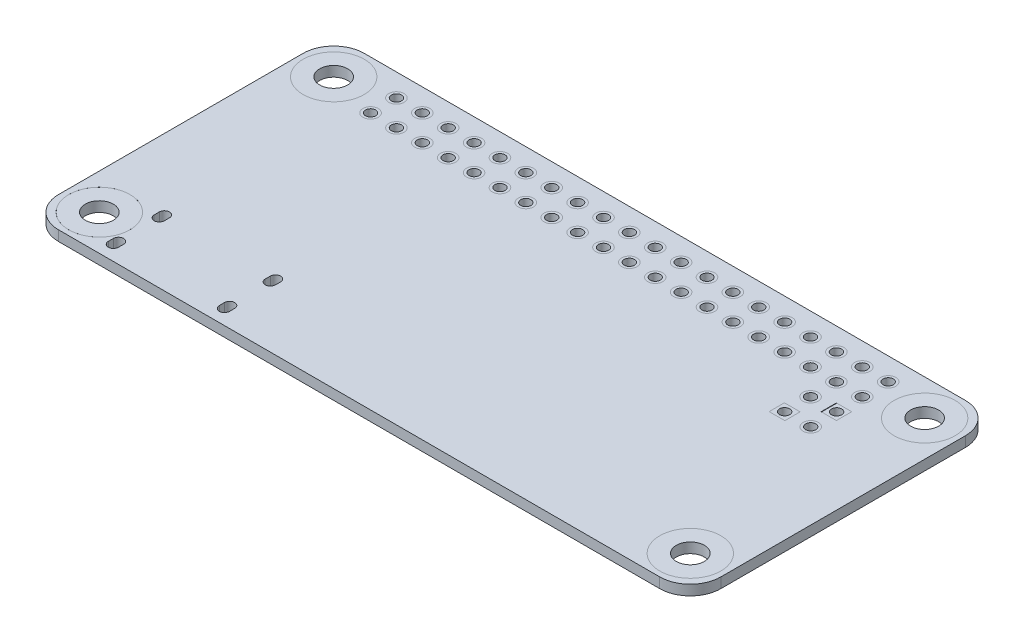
from build123d import *

# Parameters (mm, degrees)
SKETCH1_R             = 3
SKETCH1_R_2           = 0.75
SKETCH1_W             = 1.499997
SKETCH1_H             = 1.5
SKETCH1_W_2           = 1.5
BOSS_EXTRUDE1_DEPTH   = 1
SKETCH2_R             = 0.75
SKETCH2_R_2           = 0.5
BOSS_EXTRUDE2_DEPTH   = 1
LPATTERN2_COUNT       = 20
LPATTERN2_PITCH       = 2.54
LPATTERN2_2_COUNT     = 2
LPATTERN2_2_PITCH     = 2.54
SKETCH3_R             = 0.75
SKETCH3_R_2           = 0.5
BOSS_EXTRUDE3_DEPTH   = 1
BOSS_EXTRUDE3_2_DEPTH = 1
SKETCH3_W             = 1.541222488
SKETCH3_H             = 1.5
BOSS_EXTRUDE3_3_DEPTH = 1
SKETCH3_W_2           = 1.458777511
BOSS_EXTRUDE3_4_DEPTH = 1
SKETCH4_R             = 3
SKETCH4_R_2           = 1.375
BOSS_EXTRUDE4_DEPTH   = 1
CUT_EXTRUDE1_DEPTH    = 1


with BuildPart() as part:
    # Sketch1 → Boss-Extrude1 (new body)
    with BuildSketch(Plane(origin=(0, 0, 0), x_dir=(1, 0, 0), z_dir=(0, 1, 0))):
        with BuildLine():
            Line((-29.5, -15), (29.5, -15))
            ThreePointArc((29.5, -15), (31.621320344, -14.121320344), (32.5, -12))
            Line((32.5, -12), (32.5, 12))
            ThreePointArc((32.5, 12), (31.621320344, 14.121320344), (29.5, 15))
            Line((29.5, 15), (-29.5, 15))
            ThreePointArc((-29.5, 15), (-31.621320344, 14.121320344), (-32.5, 12))
            Line((-32.5, 12), (-32.5, -12))
            ThreePointArc((-32.5, -12), (-31.621320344, -14.121320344), (-29.5, -15))
        make_face()
        with Locations(Location((-29, 11.5, 0), (0, 0, 270))):
            Circle(SKETCH1_R, mode=Mode.SUBTRACT)
        with Locations(Location((-29, -11.5, 0), (0, 0, 270))):
            Circle(SKETCH1_R, mode=Mode.SUBTRACT)
        with Locations(Location((29, -11.5, 0), (0, 0, 90))):
            Circle(SKETCH1_R, mode=Mode.SUBTRACT)
        with Locations(Location((-24.13, 12.787653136, 0), (0, 0, 270))):
            Circle(SKETCH1_R_2, mode=Mode.SUBTRACT)
        with Locations(Location((-21.59, 12.787653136, 0), (0, 0, 270))):
            Circle(SKETCH1_R_2, mode=Mode.SUBTRACT)
        with Locations(Location((-19.05, 12.787653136, 0), (0, 0, 270))):
            Circle(SKETCH1_R_2, mode=Mode.SUBTRACT)
        with Locations(Location((-16.51, 12.787653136, 0), (0, 0, 270))):
            Circle(SKETCH1_R_2, mode=Mode.SUBTRACT)
        with Locations(Location((-13.97, 12.787653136, 0), (0, 0, 270))):
            Circle(SKETCH1_R_2, mode=Mode.SUBTRACT)
        with Locations(Location((-11.43, 12.787653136, 0), (0, 0, 270))):
            Circle(SKETCH1_R_2, mode=Mode.SUBTRACT)
        with Locations(Location((-8.89, 12.787653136, 0), (0, 0, 270))):
            Circle(SKETCH1_R_2, mode=Mode.SUBTRACT)
        with Locations(Location((-6.35, 12.787653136, 0), (0, 0, 270))):
            Circle(SKETCH1_R_2, mode=Mode.SUBTRACT)
        with Locations(Location((-3.81, 12.787653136, 0), (0, 0, 270))):
            Circle(SKETCH1_R_2, mode=Mode.SUBTRACT)
        with Locations(Location((-1.27, 12.787653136, 0), (0, 0, 270))):
            Circle(SKETCH1_R_2, mode=Mode.SUBTRACT)
        with Locations(Location((1.27, 12.787653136, 0), (0, 0, 270))):
            Circle(SKETCH1_R_2, mode=Mode.SUBTRACT)
        with Locations(Location((3.81, 12.787653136, 0), (0, 0, 270))):
            Circle(SKETCH1_R_2, mode=Mode.SUBTRACT)
        with Locations(Location((6.35, 12.787653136, 0), (0, 0, 270))):
            Circle(SKETCH1_R_2, mode=Mode.SUBTRACT)
        with Locations(Location((8.89, 12.787653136, 0), (0, 0, 270))):
            Circle(SKETCH1_R_2, mode=Mode.SUBTRACT)
        with Locations(Location((11.43, 12.787653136, 0), (0, 0, 270))):
            Circle(SKETCH1_R_2, mode=Mode.SUBTRACT)
        with Locations(Location((13.97, 12.787653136, 0), (0, 0, 270))):
            Circle(SKETCH1_R_2, mode=Mode.SUBTRACT)
        with Locations(Location((16.51, 12.787653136, 0), (0, 0, 270))):
            Circle(SKETCH1_R_2, mode=Mode.SUBTRACT)
        with Locations(Location((19.05, 12.787653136, 0), (0, 0, 270))):
            Circle(SKETCH1_R_2, mode=Mode.SUBTRACT)
        with Locations(Location((21.59, 12.787653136, 0), (0, 0, 270))):
            Circle(SKETCH1_R_2, mode=Mode.SUBTRACT)
        with Locations(Location((24.13, 12.787653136, 0), (0, 0, 270))):
            Circle(SKETCH1_R_2, mode=Mode.SUBTRACT)
        with Locations(Location((-21.59, 10.247653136, 0), (0, 0, 270))):
            Circle(SKETCH1_R_2, mode=Mode.SUBTRACT)
        with Locations(Location((-19.05, 10.247653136, 0), (0, 0, 270))):
            Circle(SKETCH1_R_2, mode=Mode.SUBTRACT)
        with Locations(Location((-16.51, 10.247653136, 0), (0, 0, 270))):
            Circle(SKETCH1_R_2, mode=Mode.SUBTRACT)
        with Locations(Location((-13.97, 10.247653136, 0), (0, 0, 270))):
            Circle(SKETCH1_R_2, mode=Mode.SUBTRACT)
        with Locations(Location((-11.43, 10.247653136, 0), (0, 0, 270))):
            Circle(SKETCH1_R_2, mode=Mode.SUBTRACT)
        with Locations(Location((-8.89, 10.247653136, 0), (0, 0, 270))):
            Circle(SKETCH1_R_2, mode=Mode.SUBTRACT)
        with Locations(Location((-6.35, 10.247653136, 0), (0, 0, 270))):
            Circle(SKETCH1_R_2, mode=Mode.SUBTRACT)
        with Locations(Location((-3.81, 10.247653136, 0), (0, 0, 270))):
            Circle(SKETCH1_R_2, mode=Mode.SUBTRACT)
        with Locations(Location((-1.27, 10.247653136, 0), (0, 0, 270))):
            Circle(SKETCH1_R_2, mode=Mode.SUBTRACT)
        with Locations(Location((1.27, 10.247653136, 0), (0, 0, 270))):
            Circle(SKETCH1_R_2, mode=Mode.SUBTRACT)
        with Locations(Location((3.81, 10.247653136, 0), (0, 0, 270))):
            Circle(SKETCH1_R_2, mode=Mode.SUBTRACT)
        with Locations(Location((6.35, 10.247653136, 0), (0, 0, 270))):
            Circle(SKETCH1_R_2, mode=Mode.SUBTRACT)
        with Locations(Location((8.89, 10.247653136, 0), (0, 0, 270))):
            Circle(SKETCH1_R_2, mode=Mode.SUBTRACT)
        with Locations(Location((11.43, 10.247653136, 0), (0, 0, 270))):
            Circle(SKETCH1_R_2, mode=Mode.SUBTRACT)
        with Locations(Location((13.97, 10.247653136, 0), (0, 0, 270))):
            Circle(SKETCH1_R_2, mode=Mode.SUBTRACT)
        with Locations(Location((16.51, 10.247653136, 0), (0, 0, 270))):
            Circle(SKETCH1_R_2, mode=Mode.SUBTRACT)
        with Locations(Location((19.05, 10.247653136, 0), (0, 0, 270))):
            Circle(SKETCH1_R_2, mode=Mode.SUBTRACT)
        with Locations(Location((21.59, 10.247653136, 0), (0, 0, 270))):
            Circle(SKETCH1_R_2, mode=Mode.SUBTRACT)
        with Locations(Location((24.13, 10.247653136, 0), (0, 0, 270))):
            Circle(SKETCH1_R_2, mode=Mode.SUBTRACT)
        with Locations(Location((-24.13, 10.247653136, 0), (0, 0, 270))):
            Circle(SKETCH1_R_2, mode=Mode.SUBTRACT)
        with Locations(Location((21.59002512, 7.707653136, 0), (0, 0, 270))):
            Circle(SKETCH1_R_2, mode=Mode.SUBTRACT)
        with Locations(Location((24.150636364, 5.167736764, 0), (0, 0, 270))):
            Circle(SKETCH1_R_2, mode=Mode.SUBTRACT)
        with Locations(Location((29, 11.5, 0), (0, 0, 270))):
            Circle(SKETCH1_R, mode=Mode.SUBTRACT)
        with Locations((24.13002512, 7.707653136)):
            Rectangle(SKETCH1_W, SKETCH1_H, mode=Mode.SUBTRACT)
        with Locations((21.610636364, 5.167736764)):
            Rectangle(SKETCH1_W_2, SKETCH1_H, mode=Mode.SUBTRACT)
    extrude(amount=BOSS_EXTRUDE1_DEPTH)

    # Sketch5 → Cut-Extrude1 (cut)
    with BuildSketch(Plane.XZ):
        with BuildLine():
            Line((-26.078842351, 13.039495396), (-26.078842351, 13.539495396))
            ThreePointArc((-26.078842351, 13.539495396), (-25.578842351, 14.039495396), (-25.078842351, 13.539495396))
            Line((-25.078842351, 13.539495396), (-25.078842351, 13.039495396))
            ThreePointArc((-25.078842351, 13.039495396), (-25.578842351, 12.539495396), (-26.078842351, 13.039495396))
        make_face()
        with BuildLine():
            Line((-15.178842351, 13.039495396), (-15.178842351, 13.539495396))
            ThreePointArc((-15.178842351, 13.539495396), (-14.678842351, 14.039495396), (-14.178842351, 13.539495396))
            Line((-14.178842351, 13.539495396), (-14.178842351, 13.039495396))
            ThreePointArc((-14.178842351, 13.039495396), (-14.678842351, 12.539495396), (-15.178842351, 13.039495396))
        make_face()
        with BuildLine():
            Line((-15.178842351, 8.539495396), (-15.178842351, 9.039495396))
            ThreePointArc((-15.178842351, 9.039495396), (-14.678842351, 9.539495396), (-14.178842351, 9.039495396))
            Line((-14.178842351, 9.039495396), (-14.178842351, 8.539495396))
            ThreePointArc((-14.178842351, 8.539495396), (-14.678842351, 8.039495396), (-15.178842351, 8.539495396))
        make_face()
        with BuildLine():
            Line((-26.078842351, 8.539495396), (-26.078842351, 9.039495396))
            ThreePointArc((-26.078842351, 9.039495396), (-25.578842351, 9.539495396), (-25.078842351, 9.039495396))
            Line((-25.078842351, 9.039495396), (-25.078842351, 8.539495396))
            ThreePointArc((-25.078842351, 8.539495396), (-25.578842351, 8.039495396), (-26.078842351, 8.539495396))
        make_face()
    extrude(amount=-CUT_EXTRUDE1_DEPTH, mode=Mode.SUBTRACT)


with BuildPart() as body_2:
    # Sketch2 → Boss-Extrude2 (new body)
    with BuildSketch(Plane(origin=(0, 0, 0), x_dir=(1, 0, 0), z_dir=(0, 1, 0))):
        with Locations(Location((-24.13, 12.787653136, 0), (0, 0, 270))):
            Circle(SKETCH2_R)
        with Locations(Location((-24.13, 12.787653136, 0), (0, 0, 270))):
            Circle(SKETCH2_R_2, mode=Mode.SUBTRACT)
    extrude(amount=BOSS_EXTRUDE2_DEPTH)


with BuildPart() as lpattern2_1:
    # LPattern2: pattern copy
    add(body_2.part.moved(Location(Vector(1, 0, 0) * (1 * LPATTERN2_PITCH))))


with BuildPart() as lpattern2_2:
    # LPattern2: pattern copy
    add(body_2.part.moved(Location(Vector(1, 0, 0) * (2 * LPATTERN2_PITCH))))


with BuildPart() as lpattern2_3:
    # LPattern2: pattern copy
    add(body_2.part.moved(Location(Vector(1, 0, 0) * (3 * LPATTERN2_PITCH))))


with BuildPart() as lpattern2_4:
    # LPattern2: pattern copy
    add(body_2.part.moved(Location(Vector(1, 0, 0) * (4 * LPATTERN2_PITCH))))


with BuildPart() as lpattern2_5:
    # LPattern2: pattern copy
    add(body_2.part.moved(Location(Vector(1, 0, 0) * (5 * LPATTERN2_PITCH))))


with BuildPart() as lpattern2_6:
    # LPattern2: pattern copy
    add(body_2.part.moved(Location(Vector(1, 0, 0) * (6 * LPATTERN2_PITCH))))


with BuildPart() as lpattern2_7:
    # LPattern2: pattern copy
    add(body_2.part.moved(Location(Vector(1, 0, 0) * (7 * LPATTERN2_PITCH))))


with BuildPart() as lpattern2_8:
    # LPattern2: pattern copy
    add(body_2.part.moved(Location(Vector(1, 0, 0) * (8 * LPATTERN2_PITCH))))


with BuildPart() as lpattern2_9:
    # LPattern2: pattern copy
    add(body_2.part.moved(Location(Vector(1, 0, 0) * (9 * LPATTERN2_PITCH))))


with BuildPart() as lpattern2_10:
    # LPattern2: pattern copy
    add(body_2.part.moved(Location(Vector(1, 0, 0) * (10 * LPATTERN2_PITCH))))


with BuildPart() as lpattern2_11:
    # LPattern2: pattern copy
    add(body_2.part.moved(Location(Vector(1, 0, 0) * (11 * LPATTERN2_PITCH))))


with BuildPart() as lpattern2_12:
    # LPattern2: pattern copy
    add(body_2.part.moved(Location(Vector(1, 0, 0) * (12 * LPATTERN2_PITCH))))


with BuildPart() as lpattern2_13:
    # LPattern2: pattern copy
    add(body_2.part.moved(Location(Vector(1, 0, 0) * (13 * LPATTERN2_PITCH))))


with BuildPart() as lpattern2_14:
    # LPattern2: pattern copy
    add(body_2.part.moved(Location(Vector(1, 0, 0) * (14 * LPATTERN2_PITCH))))


with BuildPart() as lpattern2_15:
    # LPattern2: pattern copy
    add(body_2.part.moved(Location(Vector(1, 0, 0) * (15 * LPATTERN2_PITCH))))


with BuildPart() as lpattern2_16:
    # LPattern2: pattern copy
    add(body_2.part.moved(Location(Vector(1, 0, 0) * (16 * LPATTERN2_PITCH))))


with BuildPart() as lpattern2_17:
    # LPattern2: pattern copy
    add(body_2.part.moved(Location(Vector(1, 0, 0) * (17 * LPATTERN2_PITCH))))


with BuildPart() as lpattern2_18:
    # LPattern2: pattern copy
    add(body_2.part.moved(Location(Vector(1, 0, 0) * (18 * LPATTERN2_PITCH))))


with BuildPart() as lpattern2_19:
    # LPattern2: pattern copy
    add(body_2.part.moved(Location(Vector(1, 0, 0) * (19 * LPATTERN2_PITCH))))


with BuildPart() as lpattern2_2_1:
    # LPattern2 2: pattern copy
    add(body_2.part.moved(Location(Vector(0, 0, 1) * (1 * LPATTERN2_2_PITCH))))


with BuildPart() as lpattern2_2_2:
    # LPattern2 2: pattern copy
    add(lpattern2_1.part.moved(Location(Vector(0, 0, 1) * (1 * LPATTERN2_2_PITCH))))


with BuildPart() as lpattern2_2_3:
    # LPattern2 2: pattern copy
    add(lpattern2_2.part.moved(Location(Vector(0, 0, 1) * (1 * LPATTERN2_2_PITCH))))


with BuildPart() as lpattern2_2_4:
    # LPattern2 2: pattern copy
    add(lpattern2_3.part.moved(Location(Vector(0, 0, 1) * (1 * LPATTERN2_2_PITCH))))


with BuildPart() as lpattern2_2_5:
    # LPattern2 2: pattern copy
    add(lpattern2_4.part.moved(Location(Vector(0, 0, 1) * (1 * LPATTERN2_2_PITCH))))


with BuildPart() as lpattern2_2_6:
    # LPattern2 2: pattern copy
    add(lpattern2_5.part.moved(Location(Vector(0, 0, 1) * (1 * LPATTERN2_2_PITCH))))


with BuildPart() as lpattern2_2_7:
    # LPattern2 2: pattern copy
    add(lpattern2_6.part.moved(Location(Vector(0, 0, 1) * (1 * LPATTERN2_2_PITCH))))


with BuildPart() as lpattern2_2_8:
    # LPattern2 2: pattern copy
    add(lpattern2_7.part.moved(Location(Vector(0, 0, 1) * (1 * LPATTERN2_2_PITCH))))


with BuildPart() as lpattern2_2_9:
    # LPattern2 2: pattern copy
    add(lpattern2_8.part.moved(Location(Vector(0, 0, 1) * (1 * LPATTERN2_2_PITCH))))


with BuildPart() as lpattern2_2_10:
    # LPattern2 2: pattern copy
    add(lpattern2_9.part.moved(Location(Vector(0, 0, 1) * (1 * LPATTERN2_2_PITCH))))


with BuildPart() as lpattern2_2_11:
    # LPattern2 2: pattern copy
    add(lpattern2_10.part.moved(Location(Vector(0, 0, 1) * (1 * LPATTERN2_2_PITCH))))


with BuildPart() as lpattern2_2_12:
    # LPattern2 2: pattern copy
    add(lpattern2_11.part.moved(Location(Vector(0, 0, 1) * (1 * LPATTERN2_2_PITCH))))


with BuildPart() as lpattern2_2_13:
    # LPattern2 2: pattern copy
    add(lpattern2_12.part.moved(Location(Vector(0, 0, 1) * (1 * LPATTERN2_2_PITCH))))


with BuildPart() as lpattern2_2_14:
    # LPattern2 2: pattern copy
    add(lpattern2_13.part.moved(Location(Vector(0, 0, 1) * (1 * LPATTERN2_2_PITCH))))


with BuildPart() as lpattern2_2_15:
    # LPattern2 2: pattern copy
    add(lpattern2_14.part.moved(Location(Vector(0, 0, 1) * (1 * LPATTERN2_2_PITCH))))


with BuildPart() as lpattern2_2_16:
    # LPattern2 2: pattern copy
    add(lpattern2_15.part.moved(Location(Vector(0, 0, 1) * (1 * LPATTERN2_2_PITCH))))


with BuildPart() as lpattern2_2_17:
    # LPattern2 2: pattern copy
    add(lpattern2_16.part.moved(Location(Vector(0, 0, 1) * (1 * LPATTERN2_2_PITCH))))


with BuildPart() as lpattern2_2_18:
    # LPattern2 2: pattern copy
    add(lpattern2_17.part.moved(Location(Vector(0, 0, 1) * (1 * LPATTERN2_2_PITCH))))


with BuildPart() as lpattern2_2_19:
    # LPattern2 2: pattern copy
    add(lpattern2_18.part.moved(Location(Vector(0, 0, 1) * (1 * LPATTERN2_2_PITCH))))


with BuildPart() as lpattern2_2_20:
    # LPattern2 2: pattern copy
    add(lpattern2_19.part.moved(Location(Vector(0, 0, 1) * (1 * LPATTERN2_2_PITCH))))


with BuildPart() as body_42:
    # Sketch3 → Boss-Extrude3 (new body)
    with BuildSketch(Plane(origin=(0, 0, 0), x_dir=(1, 0, 0), z_dir=(0, 1, 0))):
        with Locations(Location((21.59002512, 7.707653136, 0), (0, 0, 270))):
            Circle(SKETCH3_R)
        with Locations(Location((21.59002512, 7.707653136, 0), (0, 0, 270))):
            Circle(SKETCH3_R_2, mode=Mode.SUBTRACT)
    extrude(amount=BOSS_EXTRUDE3_DEPTH)


with BuildPart() as body_43:
    # Sketch3 → Boss-Extrude3 2 (new body)
    with BuildSketch(Plane(origin=(0, 0, 0), x_dir=(1, 0, 0), z_dir=(0, 1, 0))):
        with Locations(Location((24.150636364, 5.167736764, 0), (0, 0, 270))):
            Circle(SKETCH3_R)
        with Locations(Location((24.150636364, 5.167736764, 0), (0, 0, 270))):
            Circle(SKETCH3_R_2, mode=Mode.SUBTRACT)
    extrude(amount=BOSS_EXTRUDE3_2_DEPTH)


with BuildPart() as body_44:
    # Sketch3 → Boss-Extrude3 3 (new body)
    with BuildSketch(Plane(origin=(0, 0, 0), x_dir=(1, 0, 0), z_dir=(0, 1, 0))):
        with Locations((21.59002512, 5.167736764)):
            Rectangle(SKETCH3_W, SKETCH3_H)
        with Locations(Location((21.59002512, 5.167736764, 0), (0, 0, 270))):
            Circle(SKETCH3_R_2, mode=Mode.SUBTRACT)
    extrude(amount=BOSS_EXTRUDE3_3_DEPTH)


with BuildPart() as body_45:
    # Sketch3 → Boss-Extrude3 4 (new body)
    with BuildSketch(Plane(origin=(0, 0, 0), x_dir=(1, 0, 0), z_dir=(0, 1, 0))):
        with Locations((24.150634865, 7.707653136)):
            Rectangle(SKETCH3_W_2, SKETCH3_H)
        with Locations(Location((24.150634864, 7.707653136, 0), (0, 0, 270))):
            Circle(SKETCH3_R_2, mode=Mode.SUBTRACT)
    extrude(amount=BOSS_EXTRUDE3_4_DEPTH)


with BuildPart() as body_46:
    # Sketch4 → Boss-Extrude4 (new body)
    with BuildSketch(Plane(origin=(0, 0, 0), x_dir=(1, 0, 0), z_dir=(0, 1, 0))):
        with Locations(Location((-29, 11.5, 0), (0, 0, 270))):
            Circle(SKETCH4_R)
        with Locations(Location((-29, 11.5, 0), (0, 0, 270))):
            Circle(SKETCH4_R_2, mode=Mode.SUBTRACT)
    extrude(amount=BOSS_EXTRUDE4_DEPTH)


with BuildPart() as body_47:
    # Mirror1: mirrored copy
    add(body_46.part.mirror(Plane(origin=(0, 0, 0), x_dir=(0, 0, 1), z_dir=(1, 0, 0))))


with BuildPart() as body_48:
    # Mirror2: mirrored copy
    add(body_46.part.mirror(Plane.XY))


with BuildPart() as body_49:
    # Mirror2 2: mirrored copy
    add(body_47.part.mirror(Plane.XY))


solid = Compound([part.part, body_2.part, lpattern2_1.part, lpattern2_2.part, lpattern2_3.part, lpattern2_4.part, lpattern2_5.part, lpattern2_6.part, lpattern2_7.part, lpattern2_8.part, lpattern2_9.part, lpattern2_10.part, lpattern2_11.part, lpattern2_12.part, lpattern2_13.part, lpattern2_14.part, lpattern2_15.part, lpattern2_16.part, lpattern2_17.part, lpattern2_18.part, lpattern2_19.part, lpattern2_2_1.part, lpattern2_2_2.part, lpattern2_2_3.part, lpattern2_2_4.part, lpattern2_2_5.part, lpattern2_2_6.part, lpattern2_2_7.part, lpattern2_2_8.part, lpattern2_2_9.part, lpattern2_2_10.part, lpattern2_2_11.part, lpattern2_2_12.part, lpattern2_2_13.part, lpattern2_2_14.part, lpattern2_2_15.part, lpattern2_2_16.part, lpattern2_2_17.part, lpattern2_2_18.part, lpattern2_2_19.part, lpattern2_2_20.part, body_42.part, body_43.part, body_44.part, body_45.part, body_46.part, body_47.part, body_48.part, body_49.part])
